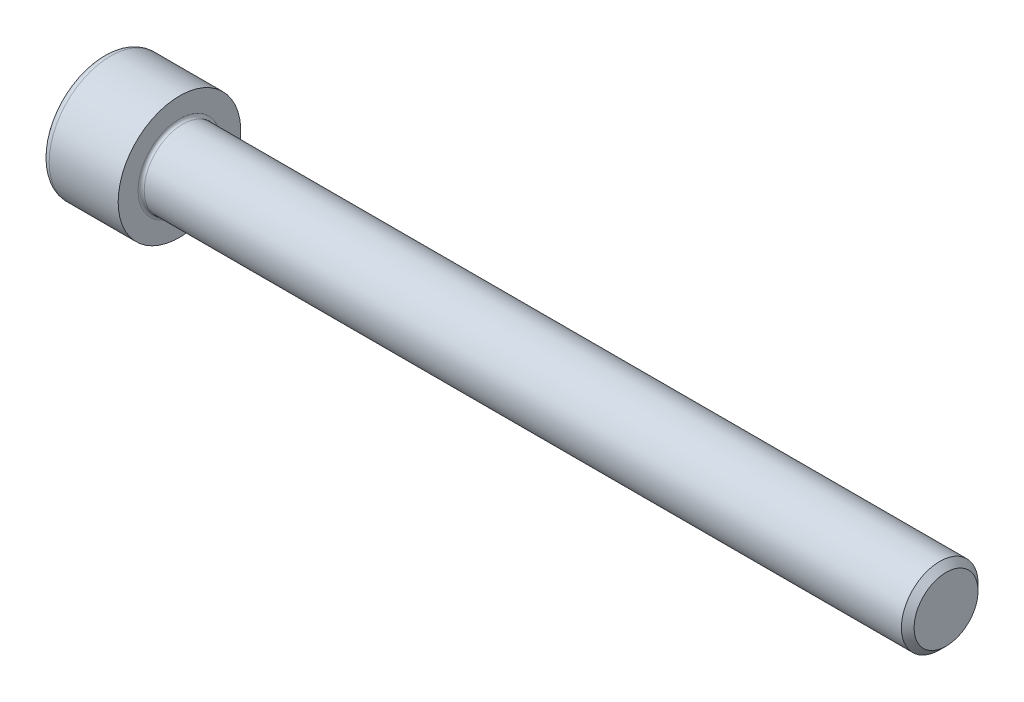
ISO-10303-21;
HEADER;
FILE_DESCRIPTION(('STEP AP214'),'2;1');
FILE_NAME('part.step','',(''),(''),'','','');
FILE_SCHEMA(('AUTOMOTIVE_DESIGN { 1 0 10303 214 1 1 1 1 }'));
ENDSEC;
DATA;
#1=APPLICATION_CONTEXT('core data for automotive mechanical design processes');
#2=APPLICATION_PROTOCOL_DEFINITION('international standard','automotive_design',2000,#1);
#3=PRODUCT_CONTEXT('',#1,'mechanical');
#4=PRODUCT('Part','Part','',(#3));
#5=PRODUCT_RELATED_PRODUCT_CATEGORY('part','',(#4));
#6=PRODUCT_DEFINITION_FORMATION('','',#4);
#7=PRODUCT_DEFINITION_CONTEXT('part definition',#1,'design');
#8=PRODUCT_DEFINITION('design','',#6,#7);
#9=PRODUCT_DEFINITION_SHAPE('','',#8);
#10=(LENGTH_UNIT() NAMED_UNIT(*) SI_UNIT(.MILLI.,.METRE.));
#11=(NAMED_UNIT(*) PLANE_ANGLE_UNIT() SI_UNIT($,.RADIAN.));
#12=(NAMED_UNIT(*) SI_UNIT($,.STERADIAN.) SOLID_ANGLE_UNIT());
#13=UNCERTAINTY_MEASURE_WITH_UNIT(LENGTH_MEASURE(1.E-05),#10,'distance_accuracy_value','');
#14=(GEOMETRIC_REPRESENTATION_CONTEXT(3) GLOBAL_UNCERTAINTY_ASSIGNED_CONTEXT((#13)) GLOBAL_UNIT_ASSIGNED_CONTEXT((#10,
#11,#12)) REPRESENTATION_CONTEXT('',''));
#15=CARTESIAN_POINT('',(0.,0.,0.));
#16=DIRECTION('',(0.,0.,1.));
#17=DIRECTION('',(1.,0.,0.));
#18=AXIS2_PLACEMENT_3D('',#15,#16,#17);
#19=CARTESIAN_POINT('',(0.,0.,0.));
#20=DIRECTION('',(-1.,0.,0.));
#21=DIRECTION('',(0.,0.,1.));
#22=AXIS2_PLACEMENT_3D('',#19,#20,#21);
#23=PLANE('',#22);
#24=DIRECTION('',(0.,-0.499999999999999,0.866025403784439));
#25=VECTOR('',#24,1.);
#26=CARTESIAN_POINT('',(0.,4.63323591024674,0.));
#27=LINE('',#26,#25);
#28=CARTESIAN_POINT('',(0.,4.63323591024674,0.));
#29=VERTEX_POINT('',#28);
#30=CARTESIAN_POINT('',(0.,2.31661795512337,4.01249999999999));
#31=VERTEX_POINT('',#30);
#32=EDGE_CURVE('E256',#29,#31,#27,.T.);
#33=ORIENTED_EDGE('',*,*,#32,.T.);
#34=DIRECTION('',(0.,1.,0.));
#35=VECTOR('',#34,1.);
#36=CARTESIAN_POINT('',(0.,-2.31661795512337,4.0125));
#37=LINE('',#36,#35);
#38=CARTESIAN_POINT('',(0.,-2.31661795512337,4.0125));
#39=VERTEX_POINT('',#38);
#40=EDGE_CURVE('E128',#39,#31,#37,.T.);
#41=ORIENTED_EDGE('',*,*,#40,.F.);
#42=DIRECTION('',(0.,-0.500000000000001,-0.866025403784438));
#43=VECTOR('',#42,1.);
#44=CARTESIAN_POINT('',(0.,-2.31661795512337,4.0125));
#45=LINE('',#44,#43);
#46=CARTESIAN_POINT('',(0.,-4.63323591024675,0.));
#47=VERTEX_POINT('',#46);
#48=EDGE_CURVE('E259',#39,#47,#45,.T.);
#49=ORIENTED_EDGE('',*,*,#48,.T.);
#50=DIRECTION('',(0.,0.499999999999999,-0.866025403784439));
#51=VECTOR('',#50,1.);
#52=CARTESIAN_POINT('',(0.,-4.63323591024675,0.));
#53=LINE('',#52,#51);
#54=CARTESIAN_POINT('',(0.,-2.31661795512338,-4.0125));
#55=VERTEX_POINT('',#54);
#56=EDGE_CURVE('E262',#47,#55,#53,.T.);
#57=ORIENTED_EDGE('',*,*,#56,.T.);
#58=DIRECTION('',(0.,-1.,0.));
#59=VECTOR('',#58,1.);
#60=CARTESIAN_POINT('',(0.,2.31661795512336,-4.0125));
#61=LINE('',#60,#59);
#62=CARTESIAN_POINT('',(0.,2.31661795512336,-4.0125));
#63=VERTEX_POINT('',#62);
#64=EDGE_CURVE('E265',#63,#55,#61,.T.);
#65=ORIENTED_EDGE('',*,*,#64,.F.);
#66=DIRECTION('',(0.,-0.500000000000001,-0.866025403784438));
#67=VECTOR('',#66,1.);
#68=CARTESIAN_POINT('',(0.,4.63323591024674,0.));
#69=LINE('',#68,#67);
#70=EDGE_CURVE('E123',#29,#63,#69,.T.);
#71=ORIENTED_EDGE('',*,*,#70,.F.);
#72=EDGE_LOOP('',(#33,#41,#49,#57,#65,#71));
#73=FACE_BOUND('',#72,.T.);
#74=CARTESIAN_POINT('',(0.,0.,0.));
#75=DIRECTION('',(-1.,0.,0.));
#76=DIRECTION('',(0.,0.,1.));
#77=AXIS2_PLACEMENT_3D('',#74,#75,#76);
#78=CIRCLE('',#77,7.);
#79=CARTESIAN_POINT('',(0.,0.,7.));
#80=VERTEX_POINT('',#79);
#81=EDGE_CURVE('E40',#80,#80,#78,.T.);
#82=ORIENTED_EDGE('',*,*,#81,.T.);
#83=EDGE_LOOP('',(#82));
#84=FACE_BOUND('',#83,.T.);
#85=ADVANCED_FACE('F32',(#73,#84),#23,.T.);
#86=CARTESIAN_POINT('',(-31.75,0.,0.));
#87=DIRECTION('',(-1.,0.,0.));
#88=DIRECTION('',(0.,0.,1.));
#89=AXIS2_PLACEMENT_3D('',#86,#87,#88);
#90=CYLINDRICAL_SURFACE('',#89,8.);
#91=CARTESIAN_POINT('',(1.,0.,0.));
#92=DIRECTION('',(-1.,0.,0.));
#93=DIRECTION('',(0.,0.,1.));
#94=AXIS2_PLACEMENT_3D('',#91,#92,#93);
#95=CIRCLE('',#94,8.);
#96=CARTESIAN_POINT('',(1.,0.,8.));
#97=VERTEX_POINT('',#96);
#98=EDGE_CURVE('E11',#97,#97,#95,.F.);
#99=ORIENTED_EDGE('',*,*,#98,.T.);
#100=EDGE_LOOP('',(#99));
#101=FACE_BOUND('',#100,.T.);
#102=CARTESIAN_POINT('',(9.99999999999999,0.,0.));
#103=DIRECTION('',(-1.,0.,0.));
#104=DIRECTION('',(0.,0.,1.));
#105=AXIS2_PLACEMENT_3D('',#102,#103,#104);
#106=CIRCLE('',#105,8.);
#107=CARTESIAN_POINT('',(9.99999999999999,0.,8.));
#108=VERTEX_POINT('',#107);
#109=EDGE_CURVE('E146',#108,#108,#106,.T.);
#110=ORIENTED_EDGE('',*,*,#109,.T.);
#111=EDGE_LOOP('',(#110));
#112=FACE_BOUND('',#111,.T.);
#113=ADVANCED_FACE('F170',(#101,#112),#90,.T.);
#114=CARTESIAN_POINT('',(9.99999999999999,8.,0.));
#115=DIRECTION('',(1.,0.,0.));
#116=DIRECTION('',(0.,0.,-1.));
#117=AXIS2_PLACEMENT_3D('',#114,#115,#116);
#118=PLANE('',#117);
#119=CARTESIAN_POINT('',(9.99999999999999,0.,0.));
#120=DIRECTION('',(1.,0.,0.));
#121=DIRECTION('',(0.,0.,-1.));
#122=AXIS2_PLACEMENT_3D('',#119,#120,#121);
#123=CIRCLE('',#122,5.4);
#124=CARTESIAN_POINT('',(9.99999999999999,0.,-5.4));
#125=VERTEX_POINT('',#124);
#126=EDGE_CURVE('E149',#125,#125,#123,.F.);
#127=ORIENTED_EDGE('',*,*,#126,.T.);
#128=EDGE_LOOP('',(#127));
#129=FACE_BOUND('',#128,.T.);
#130=ORIENTED_EDGE('',*,*,#109,.F.);
#131=EDGE_LOOP('',(#130));
#132=FACE_BOUND('',#131,.T.);
#133=ADVANCED_FACE('F176',(#129,#132),#118,.T.);
#134=CARTESIAN_POINT('',(-31.75,0.,0.));
#135=DIRECTION('',(-1.,0.,0.));
#136=DIRECTION('',(0.,0.,1.));
#137=AXIS2_PLACEMENT_3D('',#134,#135,#136);
#138=CYLINDRICAL_SURFACE('',#137,5.);
#139=CARTESIAN_POINT('',(10.4,0.,0.));
#140=DIRECTION('',(1.,0.,0.));
#141=DIRECTION('',(0.,0.,-1.));
#142=AXIS2_PLACEMENT_3D('',#139,#140,#141);
#143=CIRCLE('',#142,5.);
#144=CARTESIAN_POINT('',(10.4,0.,-5.));
#145=VERTEX_POINT('',#144);
#146=EDGE_CURVE('E152',#145,#145,#143,.T.);
#147=ORIENTED_EDGE('',*,*,#146,.T.);
#148=EDGE_LOOP('',(#147));
#149=FACE_BOUND('',#148,.T.);
#150=CARTESIAN_POINT('',(109.172,0.,0.));
#151=DIRECTION('',(-1.,0.,0.));
#152=DIRECTION('',(0.,0.,1.));
#153=AXIS2_PLACEMENT_3D('',#150,#151,#152);
#154=CIRCLE('',#153,5.);
#155=CARTESIAN_POINT('',(109.172,0.,5.));
#156=VERTEX_POINT('',#155);
#157=EDGE_CURVE('E143',#156,#156,#154,.T.);
#158=ORIENTED_EDGE('',*,*,#157,.T.);
#159=EDGE_LOOP('',(#158));
#160=FACE_BOUND('',#159,.T.);
#161=ADVANCED_FACE('F182',(#149,#160),#138,.T.);
#162=CARTESIAN_POINT('',(110.,0.,0.));
#163=DIRECTION('',(-1.,0.,0.));
#164=DIRECTION('',(0.,0.,1.));
#165=AXIS2_PLACEMENT_3D('',#162,#163,#164);
#166=CONICAL_SURFACE('',#165,4.172,0.785398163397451);
#167=ORIENTED_EDGE('',*,*,#157,.F.);
#168=EDGE_LOOP('',(#167));
#169=FACE_BOUND('',#168,.T.);
#170=CARTESIAN_POINT('',(110.,0.,0.));
#171=DIRECTION('',(-1.,0.,0.));
#172=DIRECTION('',(0.,0.,1.));
#173=AXIS2_PLACEMENT_3D('',#170,#171,#172);
#174=CIRCLE('',#173,4.172);
#175=CARTESIAN_POINT('',(110.,0.,4.172));
#176=VERTEX_POINT('',#175);
#177=EDGE_CURVE('E139',#176,#176,#174,.T.);
#178=ORIENTED_EDGE('',*,*,#177,.T.);
#179=EDGE_LOOP('',(#178));
#180=FACE_BOUND('',#179,.T.);
#181=ADVANCED_FACE('F186',(#169,#180),#166,.T.);
#182=CARTESIAN_POINT('',(110.,4.172,0.));
#183=DIRECTION('',(1.,0.,0.));
#184=DIRECTION('',(0.,0.,-1.));
#185=AXIS2_PLACEMENT_3D('',#182,#183,#184);
#186=PLANE('',#185);
#187=ORIENTED_EDGE('',*,*,#177,.F.);
#188=EDGE_LOOP('',(#187));
#189=FACE_BOUND('',#188,.T.);
#190=ADVANCED_FACE('F166',(#189),#186,.T.);
#191=CARTESIAN_POINT('',(10.4,0.,0.));
#192=DIRECTION('',(1.,0.,0.));
#193=DIRECTION('',(0.,0.,-1.));
#194=AXIS2_PLACEMENT_3D('',#191,#192,#193);
#195=TOROIDAL_SURFACE('',#194,5.4,0.4);
#196=ORIENTED_EDGE('',*,*,#146,.F.);
#197=EDGE_LOOP('',(#196));
#198=FACE_BOUND('',#197,.T.);
#199=ORIENTED_EDGE('',*,*,#126,.F.);
#200=EDGE_LOOP('',(#199));
#201=FACE_BOUND('',#200,.T.);
#202=ADVANCED_FACE('F159',(#198,#201),#195,.F.);
#203=CARTESIAN_POINT('',(1.,0.,0.));
#204=DIRECTION('',(-1.,0.,0.));
#205=DIRECTION('',(0.,0.,1.));
#206=AXIS2_PLACEMENT_3D('',#203,#204,#205);
#207=TOROIDAL_SURFACE('',#206,7.,1.);
#208=ORIENTED_EDGE('',*,*,#98,.F.);
#209=EDGE_LOOP('',(#208));
#210=FACE_BOUND('',#209,.T.);
#211=ORIENTED_EDGE('',*,*,#81,.F.);
#212=EDGE_LOOP('',(#211));
#213=FACE_BOUND('',#212,.T.);
#214=ADVANCED_FACE('F34',(#210,#213),#207,.T.);
#215=CARTESIAN_POINT('',(5.,4.63323591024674,0.));
#216=DIRECTION('',(0.,-0.866025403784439,-0.499999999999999));
#217=DIRECTION('',(0.,0.499999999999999,-0.866025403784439));
#218=AXIS2_PLACEMENT_3D('',#215,#216,#217);
#219=PLANE('',#218);
#220=ORIENTED_EDGE('',*,*,#32,.F.);
#221=DIRECTION('',(-1.,0.,0.));
#222=VECTOR('',#221,1.);
#223=CARTESIAN_POINT('',(5.,4.63323591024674,0.));
#224=LINE('',#223,#222);
#225=CARTESIAN_POINT('',(5.,4.63323591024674,0.));
#226=VERTEX_POINT('',#225);
#227=EDGE_CURVE('E246',#226,#29,#224,.T.);
#228=ORIENTED_EDGE('',*,*,#227,.F.);
#229=DIRECTION('',(0.,-0.499999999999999,0.866025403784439));
#230=VECTOR('',#229,1.);
#231=CARTESIAN_POINT('',(5.,4.63323591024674,0.));
#232=LINE('',#231,#230);
#233=CARTESIAN_POINT('',(5.,3.47492693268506,2.00624999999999));
#234=VERTEX_POINT('',#233);
#235=EDGE_CURVE('E115',#226,#234,#232,.T.);
#236=ORIENTED_EDGE('',*,*,#235,.T.);
#237=CARTESIAN_POINT('',(5.,2.31661795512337,4.01249999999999));
#238=VERTEX_POINT('',#237);
#239=EDGE_CURVE('E106',#234,#238,#232,.T.);
#240=ORIENTED_EDGE('',*,*,#239,.T.);
#241=DIRECTION('',(-1.,0.,0.));
#242=VECTOR('',#241,1.);
#243=CARTESIAN_POINT('',(5.,2.31661795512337,4.01249999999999));
#244=LINE('',#243,#242);
#245=EDGE_CURVE('E120',#238,#31,#244,.T.);
#246=ORIENTED_EDGE('',*,*,#245,.T.);
#247=EDGE_LOOP('',(#220,#228,#236,#240,#246));
#248=FACE_BOUND('',#247,.T.);
#249=ADVANCED_FACE('F119',(#248),#219,.T.);
#250=CARTESIAN_POINT('',(5.,-2.31661795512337,4.0125));
#251=DIRECTION('',(0.,0.,1.));
#252=DIRECTION('',(0.,-1.,0.));
#253=AXIS2_PLACEMENT_3D('',#250,#251,#252);
#254=PLANE('',#253);
#255=ORIENTED_EDGE('',*,*,#40,.T.);
#256=ORIENTED_EDGE('',*,*,#245,.F.);
#257=DIRECTION('',(0.,1.,0.));
#258=VECTOR('',#257,1.);
#259=CARTESIAN_POINT('',(5.,-2.31661795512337,4.0125));
#260=LINE('',#259,#258);
#261=CARTESIAN_POINT('',(5.,0.,4.0125));
#262=VERTEX_POINT('',#261);
#263=EDGE_CURVE('E103',#262,#238,#260,.T.);
#264=ORIENTED_EDGE('',*,*,#263,.F.);
#265=CARTESIAN_POINT('',(5.,-2.31661795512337,4.0125));
#266=VERTEX_POINT('',#265);
#267=EDGE_CURVE('E114',#266,#262,#260,.T.);
#268=ORIENTED_EDGE('',*,*,#267,.F.);
#269=DIRECTION('',(-1.,0.,0.));
#270=VECTOR('',#269,1.);
#271=CARTESIAN_POINT('',(5.,-2.31661795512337,4.0125));
#272=LINE('',#271,#270);
#273=EDGE_CURVE('E130',#266,#39,#272,.T.);
#274=ORIENTED_EDGE('',*,*,#273,.T.);
#275=EDGE_LOOP('',(#255,#256,#264,#268,#274));
#276=FACE_BOUND('',#275,.T.);
#277=ADVANCED_FACE('F125',(#276),#254,.F.);
#278=CARTESIAN_POINT('',(5.,-2.31661795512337,4.0125));
#279=DIRECTION('',(0.,0.866025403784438,-0.500000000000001));
#280=DIRECTION('',(0.,0.500000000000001,0.866025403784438));
#281=AXIS2_PLACEMENT_3D('',#278,#279,#280);
#282=PLANE('',#281);
#283=ORIENTED_EDGE('',*,*,#48,.F.);
#284=ORIENTED_EDGE('',*,*,#273,.F.);
#285=DIRECTION('',(0.,-0.500000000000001,-0.866025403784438));
#286=VECTOR('',#285,1.);
#287=CARTESIAN_POINT('',(5.,-2.31661795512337,4.0125));
#288=LINE('',#287,#286);
#289=CARTESIAN_POINT('',(5.,-3.47492693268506,2.00625));
#290=VERTEX_POINT('',#289);
#291=EDGE_CURVE('E285',#266,#290,#288,.T.);
#292=ORIENTED_EDGE('',*,*,#291,.T.);
#293=CARTESIAN_POINT('',(5.,-4.63323591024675,0.));
#294=VERTEX_POINT('',#293);
#295=EDGE_CURVE('E274',#290,#294,#288,.T.);
#296=ORIENTED_EDGE('',*,*,#295,.T.);
#297=DIRECTION('',(-1.,0.,0.));
#298=VECTOR('',#297,1.);
#299=CARTESIAN_POINT('',(5.,-4.63323591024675,0.));
#300=LINE('',#299,#298);
#301=EDGE_CURVE('E135',#294,#47,#300,.T.);
#302=ORIENTED_EDGE('',*,*,#301,.T.);
#303=EDGE_LOOP('',(#283,#284,#292,#296,#302));
#304=FACE_BOUND('',#303,.T.);
#305=ADVANCED_FACE('F200',(#304),#282,.T.);
#306=CARTESIAN_POINT('',(5.,-4.63323591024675,0.));
#307=DIRECTION('',(0.,0.866025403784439,0.499999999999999));
#308=DIRECTION('',(0.,-0.499999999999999,0.866025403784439));
#309=AXIS2_PLACEMENT_3D('',#306,#307,#308);
#310=PLANE('',#309);
#311=ORIENTED_EDGE('',*,*,#56,.F.);
#312=ORIENTED_EDGE('',*,*,#301,.F.);
#313=DIRECTION('',(0.,0.499999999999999,-0.866025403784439));
#314=VECTOR('',#313,1.);
#315=CARTESIAN_POINT('',(5.,-4.63323591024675,0.));
#316=LINE('',#315,#314);
#317=CARTESIAN_POINT('',(5.,-3.47492693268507,-2.00625));
#318=VERTEX_POINT('',#317);
#319=EDGE_CURVE('E252',#294,#318,#316,.T.);
#320=ORIENTED_EDGE('',*,*,#319,.T.);
#321=CARTESIAN_POINT('',(5.,-2.31661795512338,-4.0125));
#322=VERTEX_POINT('',#321);
#323=EDGE_CURVE('E284',#318,#322,#316,.T.);
#324=ORIENTED_EDGE('',*,*,#323,.T.);
#325=DIRECTION('',(-1.,0.,0.));
#326=VECTOR('',#325,1.);
#327=CARTESIAN_POINT('',(5.,-2.31661795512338,-4.0125));
#328=LINE('',#327,#326);
#329=EDGE_CURVE('E245',#322,#55,#328,.T.);
#330=ORIENTED_EDGE('',*,*,#329,.T.);
#331=EDGE_LOOP('',(#311,#312,#320,#324,#330));
#332=FACE_BOUND('',#331,.T.);
#333=ADVANCED_FACE('F203',(#332),#310,.T.);
#334=CARTESIAN_POINT('',(5.,2.31661795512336,-4.0125));
#335=DIRECTION('',(0.,0.,-1.));
#336=DIRECTION('',(0.,1.,0.));
#337=AXIS2_PLACEMENT_3D('',#334,#335,#336);
#338=PLANE('',#337);
#339=ORIENTED_EDGE('',*,*,#64,.T.);
#340=ORIENTED_EDGE('',*,*,#329,.F.);
#341=DIRECTION('',(0.,-1.,0.));
#342=VECTOR('',#341,1.);
#343=CARTESIAN_POINT('',(5.,2.31661795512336,-4.0125));
#344=LINE('',#343,#342);
#345=CARTESIAN_POINT('',(5.,0.,-4.0125));
#346=VERTEX_POINT('',#345);
#347=EDGE_CURVE('E249',#346,#322,#344,.T.);
#348=ORIENTED_EDGE('',*,*,#347,.F.);
#349=CARTESIAN_POINT('',(5.,2.31661795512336,-4.0125));
#350=VERTEX_POINT('',#349);
#351=EDGE_CURVE('E47',#350,#346,#344,.T.);
#352=ORIENTED_EDGE('',*,*,#351,.F.);
#353=DIRECTION('',(-1.,0.,0.));
#354=VECTOR('',#353,1.);
#355=CARTESIAN_POINT('',(5.,2.31661795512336,-4.0125));
#356=LINE('',#355,#354);
#357=EDGE_CURVE('E242',#350,#63,#356,.T.);
#358=ORIENTED_EDGE('',*,*,#357,.T.);
#359=EDGE_LOOP('',(#339,#340,#348,#352,#358));
#360=FACE_BOUND('',#359,.T.);
#361=ADVANCED_FACE('F207',(#360),#338,.F.);
#362=CARTESIAN_POINT('',(5.,4.63323591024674,0.));
#363=DIRECTION('',(0.,0.866025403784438,-0.500000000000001));
#364=DIRECTION('',(0.,0.500000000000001,0.866025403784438));
#365=AXIS2_PLACEMENT_3D('',#362,#363,#364);
#366=PLANE('',#365);
#367=ORIENTED_EDGE('',*,*,#70,.T.);
#368=ORIENTED_EDGE('',*,*,#357,.F.);
#369=DIRECTION('',(0.,-0.500000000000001,-0.866025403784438));
#370=VECTOR('',#369,1.);
#371=CARTESIAN_POINT('',(5.,4.63323591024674,0.));
#372=LINE('',#371,#370);
#373=CARTESIAN_POINT('',(5.,3.47492693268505,-2.00625));
#374=VERTEX_POINT('',#373);
#375=EDGE_CURVE('E232',#374,#350,#372,.T.);
#376=ORIENTED_EDGE('',*,*,#375,.F.);
#377=EDGE_CURVE('E238',#226,#374,#372,.T.);
#378=ORIENTED_EDGE('',*,*,#377,.F.);
#379=ORIENTED_EDGE('',*,*,#227,.T.);
#380=EDGE_LOOP('',(#367,#368,#376,#378,#379));
#381=FACE_BOUND('',#380,.T.);
#382=ADVANCED_FACE('F211',(#381),#366,.F.);
#383=CARTESIAN_POINT('',(5.,4.63323591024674,0.));
#384=DIRECTION('',(1.,0.,0.));
#385=DIRECTION('',(0.,0.,-1.));
#386=AXIS2_PLACEMENT_3D('',#383,#384,#385);
#387=PLANE('',#386);
#388=ORIENTED_EDGE('',*,*,#347,.T.);
#389=ORIENTED_EDGE('',*,*,#323,.F.);
#390=CARTESIAN_POINT('',(5.,0.,0.));
#391=DIRECTION('',(-1.,0.,0.));
#392=DIRECTION('',(0.,0.,1.));
#393=AXIS2_PLACEMENT_3D('',#390,#391,#392);
#394=CIRCLE('',#393,4.0125);
#395=EDGE_CURVE('E280',#346,#318,#394,.T.);
#396=ORIENTED_EDGE('',*,*,#395,.F.);
#397=EDGE_LOOP('',(#388,#389,#396));
#398=FACE_BOUND('',#397,.T.);
#399=ADVANCED_FACE('F215',(#398),#387,.F.);
#400=ORIENTED_EDGE('',*,*,#319,.F.);
#401=ORIENTED_EDGE('',*,*,#295,.F.);
#402=EDGE_CURVE('E133',#318,#290,#394,.T.);
#403=ORIENTED_EDGE('',*,*,#402,.F.);
#404=EDGE_LOOP('',(#400,#401,#403));
#405=FACE_BOUND('',#404,.T.);
#406=ADVANCED_FACE('F218',(#405),#387,.F.);
#407=ORIENTED_EDGE('',*,*,#291,.F.);
#408=ORIENTED_EDGE('',*,*,#267,.T.);
#409=EDGE_CURVE('E129',#290,#262,#394,.T.);
#410=ORIENTED_EDGE('',*,*,#409,.F.);
#411=EDGE_LOOP('',(#407,#408,#410));
#412=FACE_BOUND('',#411,.T.);
#413=ADVANCED_FACE('F223',(#412),#387,.F.);
#414=ORIENTED_EDGE('',*,*,#263,.T.);
#415=ORIENTED_EDGE('',*,*,#239,.F.);
#416=EDGE_CURVE('E109',#262,#234,#394,.T.);
#417=ORIENTED_EDGE('',*,*,#416,.F.);
#418=EDGE_LOOP('',(#414,#415,#417));
#419=FACE_BOUND('',#418,.T.);
#420=ADVANCED_FACE('F105',(#419),#387,.F.);
#421=ORIENTED_EDGE('',*,*,#235,.F.);
#422=ORIENTED_EDGE('',*,*,#377,.T.);
#423=EDGE_CURVE('E140',#234,#374,#394,.T.);
#424=ORIENTED_EDGE('',*,*,#423,.F.);
#425=EDGE_LOOP('',(#421,#422,#424));
#426=FACE_BOUND('',#425,.T.);
#427=ADVANCED_FACE('F226',(#426),#387,.F.);
#428=ORIENTED_EDGE('',*,*,#375,.T.);
#429=ORIENTED_EDGE('',*,*,#351,.T.);
#430=EDGE_CURVE('E235',#374,#346,#394,.T.);
#431=ORIENTED_EDGE('',*,*,#430,.F.);
#432=EDGE_LOOP('',(#428,#429,#431));
#433=FACE_BOUND('',#432,.T.);
#434=ADVANCED_FACE('F196',(#433),#387,.F.);
#435=CARTESIAN_POINT('',(5.,0.,0.));
#436=DIRECTION('',(-1.,0.,0.));
#437=DIRECTION('',(0.,0.,1.));
#438=AXIS2_PLACEMENT_3D('',#435,#436,#437);
#439=CONICAL_SURFACE('',#438,4.0125,1.04719755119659);
#440=CARTESIAN_POINT('',(7.31661795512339,0.,0.));
#441=VERTEX_POINT('',#440);
#442=VERTEX_LOOP('',#441);
#443=FACE_BOUND('',#442,.T.);
#444=ORIENTED_EDGE('',*,*,#416,.T.);
#445=ORIENTED_EDGE('',*,*,#423,.T.);
#446=ORIENTED_EDGE('',*,*,#430,.T.);
#447=ORIENTED_EDGE('',*,*,#395,.T.);
#448=ORIENTED_EDGE('',*,*,#402,.T.);
#449=ORIENTED_EDGE('',*,*,#409,.T.);
#450=EDGE_LOOP('',(#444,#445,#446,#447,#448,#449));
#451=FACE_BOUND('',#450,.T.);
#452=ADVANCED_FACE('F194',(#443,#451),#439,.F.);
#453=CLOSED_SHELL('',(#85,#113,#133,#161,#181,#190,#202,#214,#249,#277,#305,#333,#361,#382,#399,
#406,#413,#420,#427,#434,#452));
#454=MANIFOLD_SOLID_BREP('B2',#453);
#455=ADVANCED_BREP_SHAPE_REPRESENTATION('',(#18,#454),#14);
#456=SHAPE_DEFINITION_REPRESENTATION(#9,#455);
ENDSEC;
END-ISO-10303-21;
